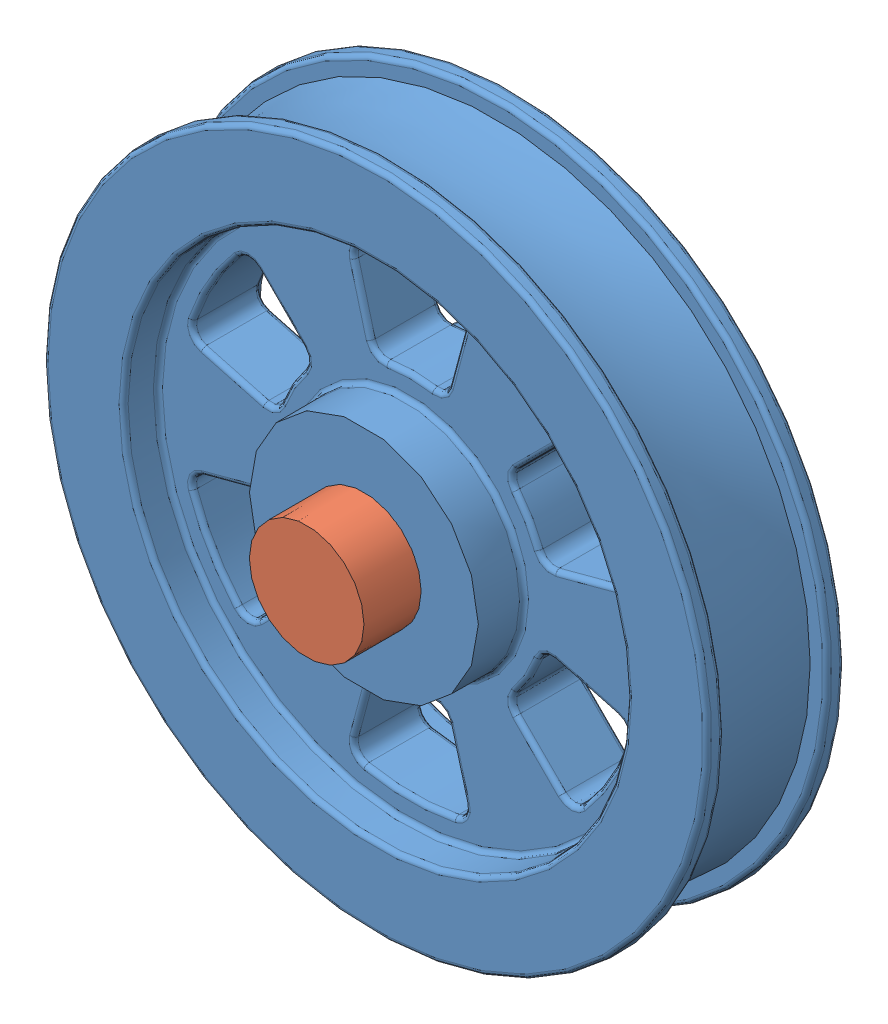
SolidWorks assembly Wheel Shaft Assembly.SLDASM, configuration Default (file format 4100). Lengths in mm.
Overall size (368.3 368.3 152.4).
2 component instances, 2 part files, 2 mates.
Components (placement in the parent):
- wheel-1: wheel.SLDPRT [Default] at origin size (368.3 368.3 88.9)
- Shaft-2: Shaft.SLDPRT [Default] at origin size (63.6 63.6 152.4)
Mates (geometry in assembly coordinates):
- Concentric1: concentric anti-aligned: cylinder of wheel-1 through (0 0 130.7747) axis (0 0 1) radius 31.75; cylinder of Shaft-2 through (0 0 76.2) axis (0 0 -1) radius 31.8021
- Coincident1: coincident = 201.8554 mm: point of ?
